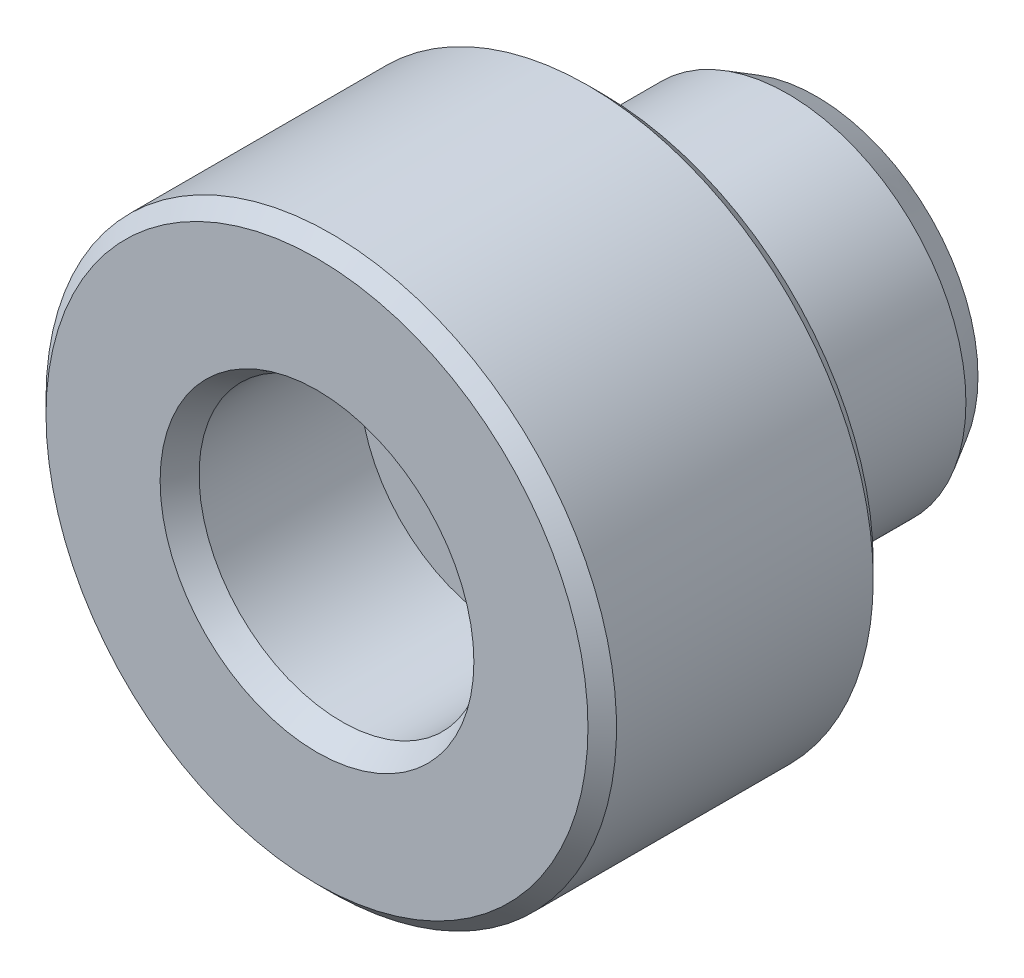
ISO-10303-21;
HEADER;
FILE_DESCRIPTION(('STEP AP214'),'2;1');
FILE_NAME('part.step','',(''),(''),'','','');
FILE_SCHEMA(('AUTOMOTIVE_DESIGN { 1 0 10303 214 1 1 1 1 }'));
ENDSEC;
DATA;
#1=APPLICATION_CONTEXT('core data for automotive mechanical design processes');
#2=APPLICATION_PROTOCOL_DEFINITION('international standard','automotive_design',2000,#1);
#3=PRODUCT_CONTEXT('',#1,'mechanical');
#4=PRODUCT('Part','Part','',(#3));
#5=PRODUCT_RELATED_PRODUCT_CATEGORY('part','',(#4));
#6=PRODUCT_DEFINITION_FORMATION('','',#4);
#7=PRODUCT_DEFINITION_CONTEXT('part definition',#1,'design');
#8=PRODUCT_DEFINITION('design','',#6,#7);
#9=PRODUCT_DEFINITION_SHAPE('','',#8);
#10=(LENGTH_UNIT() NAMED_UNIT(*) SI_UNIT(.MILLI.,.METRE.));
#11=(NAMED_UNIT(*) PLANE_ANGLE_UNIT() SI_UNIT($,.RADIAN.));
#12=(NAMED_UNIT(*) SI_UNIT($,.STERADIAN.) SOLID_ANGLE_UNIT());
#13=UNCERTAINTY_MEASURE_WITH_UNIT(LENGTH_MEASURE(1.E-05),#10,'distance_accuracy_value','');
#14=(GEOMETRIC_REPRESENTATION_CONTEXT(3) GLOBAL_UNCERTAINTY_ASSIGNED_CONTEXT((#13)) GLOBAL_UNIT_ASSIGNED_CONTEXT((#10,
#11,#12)) REPRESENTATION_CONTEXT('',''));
#15=CARTESIAN_POINT('',(0.,0.,0.));
#16=DIRECTION('',(0.,0.,1.));
#17=DIRECTION('',(1.,0.,0.));
#18=AXIS2_PLACEMENT_3D('',#15,#16,#17);
#19=CARTESIAN_POINT('',(0.,0.,-22.5684167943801));
#20=DIRECTION('',(0.,0.,-1.));
#21=DIRECTION('',(-1.,0.,0.));
#22=AXIS2_PLACEMENT_3D('',#19,#20,#21);
#23=CYLINDRICAL_SURFACE('',#22,20.);
#24=CARTESIAN_POINT('',(0.,0.,1.));
#25=DIRECTION('',(0.,0.,1.));
#26=DIRECTION('',(1.,0.,0.));
#27=AXIS2_PLACEMENT_3D('',#24,#25,#26);
#28=CIRCLE('',#27,20.);
#29=CARTESIAN_POINT('',(20.,0.,1.));
#30=VERTEX_POINT('',#29);
#31=EDGE_CURVE('E19',#30,#30,#28,.T.);
#32=ORIENTED_EDGE('',*,*,#31,.T.);
#33=EDGE_LOOP('',(#32));
#34=FACE_BOUND('',#33,.T.);
#35=CARTESIAN_POINT('',(0.,0.,19.));
#36=DIRECTION('',(0.,0.,-1.));
#37=DIRECTION('',(-1.,0.,0.));
#38=AXIS2_PLACEMENT_3D('',#35,#36,#37);
#39=CIRCLE('',#38,20.);
#40=CARTESIAN_POINT('',(-20.,0.,19.));
#41=VERTEX_POINT('',#40);
#42=EDGE_CURVE('E23',#41,#41,#39,.T.);
#43=ORIENTED_EDGE('',*,*,#42,.T.);
#44=EDGE_LOOP('',(#43));
#45=FACE_BOUND('',#44,.T.);
#46=ADVANCED_FACE('F12',(#34,#45),#23,.T.);
#47=CARTESIAN_POINT('',(13.7,0.,0.));
#48=DIRECTION('',(0.,0.,1.));
#49=DIRECTION('',(1.,0.,0.));
#50=AXIS2_PLACEMENT_3D('',#47,#48,#49);
#51=PLANE('',#50);
#52=CARTESIAN_POINT('',(0.,0.,0.));
#53=DIRECTION('',(0.,0.,1.));
#54=DIRECTION('',(1.,0.,0.));
#55=AXIS2_PLACEMENT_3D('',#52,#53,#54);
#56=CIRCLE('',#55,12.5);
#57=CARTESIAN_POINT('',(12.5,0.,0.));
#58=VERTEX_POINT('',#57);
#59=EDGE_CURVE('E56',#58,#58,#56,.T.);
#60=ORIENTED_EDGE('',*,*,#59,.T.);
#61=EDGE_LOOP('',(#60));
#62=FACE_BOUND('',#61,.T.);
#63=CARTESIAN_POINT('',(0.,0.,0.));
#64=DIRECTION('',(0.,0.,1.));
#65=DIRECTION('',(1.,0.,0.));
#66=AXIS2_PLACEMENT_3D('',#63,#64,#65);
#67=CIRCLE('',#66,19.);
#68=CARTESIAN_POINT('',(19.,0.,0.));
#69=VERTEX_POINT('',#68);
#70=EDGE_CURVE('E27',#69,#69,#67,.F.);
#71=ORIENTED_EDGE('',*,*,#70,.T.);
#72=EDGE_LOOP('',(#71));
#73=FACE_BOUND('',#72,.T.);
#74=ADVANCED_FACE('F60',(#62,#73),#51,.F.);
#75=CARTESIAN_POINT('',(0.,0.,-22.5684167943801));
#76=DIRECTION('',(0.,0.,-1.));
#77=DIRECTION('',(-1.,0.,0.));
#78=AXIS2_PLACEMENT_3D('',#75,#76,#77);
#79=CYLINDRICAL_SURFACE('',#78,12.5);
#80=CARTESIAN_POINT('',(0.,0.,-13.));
#81=DIRECTION('',(0.,0.,1.));
#82=DIRECTION('',(1.,0.,0.));
#83=AXIS2_PLACEMENT_3D('',#80,#81,#82);
#84=CIRCLE('',#83,12.5);
#85=CARTESIAN_POINT('',(12.5,0.,-13.));
#86=VERTEX_POINT('',#85);
#87=EDGE_CURVE('E32',#86,#86,#84,.T.);
#88=ORIENTED_EDGE('',*,*,#87,.T.);
#89=EDGE_LOOP('',(#88));
#90=FACE_BOUND('',#89,.T.);
#91=ORIENTED_EDGE('',*,*,#59,.F.);
#92=EDGE_LOOP('',(#91));
#93=FACE_BOUND('',#92,.T.);
#94=ADVANCED_FACE('F63',(#90,#93),#79,.T.);
#95=CARTESIAN_POINT('',(0.,0.,-15.));
#96=DIRECTION('',(0.,0.,1.));
#97=DIRECTION('',(1.,0.,0.));
#98=AXIS2_PLACEMENT_3D('',#95,#96,#97);
#99=PLANE('',#98);
#100=CARTESIAN_POINT('',(0.,0.,-15.));
#101=DIRECTION('',(0.,0.,1.));
#102=DIRECTION('',(1.,0.,0.));
#103=AXIS2_PLACEMENT_3D('',#100,#101,#102);
#104=CIRCLE('',#103,11.3452994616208);
#105=CARTESIAN_POINT('',(11.3452994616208,0.,-15.));
#106=VERTEX_POINT('',#105);
#107=EDGE_CURVE('E35',#106,#106,#104,.F.);
#108=ORIENTED_EDGE('',*,*,#107,.T.);
#109=EDGE_LOOP('',(#108));
#110=FACE_BOUND('',#109,.T.);
#111=CARTESIAN_POINT('',(0.,0.,-15.));
#112=DIRECTION('',(0.,0.,1.));
#113=DIRECTION('',(1.,0.,0.));
#114=AXIS2_PLACEMENT_3D('',#111,#112,#113);
#115=CIRCLE('',#114,8.);
#116=CARTESIAN_POINT('',(8.,0.,-15.));
#117=VERTEX_POINT('',#116);
#118=EDGE_CURVE('E38',#117,#117,#115,.T.);
#119=ORIENTED_EDGE('',*,*,#118,.T.);
#120=EDGE_LOOP('',(#119));
#121=FACE_BOUND('',#120,.T.);
#122=ADVANCED_FACE('F65',(#110,#121),#99,.F.);
#123=CARTESIAN_POINT('',(20.,0.,20.));
#124=DIRECTION('',(0.,0.,-1.));
#125=DIRECTION('',(-1.,0.,0.));
#126=AXIS2_PLACEMENT_3D('',#123,#124,#125);
#127=PLANE('',#126);
#128=CARTESIAN_POINT('',(0.,0.,20.));
#129=DIRECTION('',(0.,0.,-1.));
#130=DIRECTION('',(-1.,0.,0.));
#131=AXIS2_PLACEMENT_3D('',#128,#129,#130);
#132=CIRCLE('',#131,19.);
#133=CARTESIAN_POINT('',(-19.,0.,20.));
#134=VERTEX_POINT('',#133);
#135=EDGE_CURVE('E8',#134,#134,#132,.F.);
#136=ORIENTED_EDGE('',*,*,#135,.T.);
#137=EDGE_LOOP('',(#136));
#138=FACE_BOUND('',#137,.T.);
#139=CARTESIAN_POINT('',(0.,0.,20.));
#140=DIRECTION('',(0.,0.,1.));
#141=DIRECTION('',(1.,0.,0.));
#142=AXIS2_PLACEMENT_3D('',#139,#140,#141);
#143=CIRCLE('',#142,11.);
#144=CARTESIAN_POINT('',(11.,0.,20.));
#145=VERTEX_POINT('',#144);
#146=EDGE_CURVE('E53',#145,#145,#143,.T.);
#147=ORIENTED_EDGE('',*,*,#146,.F.);
#148=EDGE_LOOP('',(#147));
#149=FACE_BOUND('',#148,.T.);
#150=ADVANCED_FACE('F73',(#138,#149),#127,.F.);
#151=CARTESIAN_POINT('',(0.,0.,-13.2679491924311));
#152=DIRECTION('',(0.,0.,-1.));
#153=DIRECTION('',(-1.,0.,0.));
#154=AXIS2_PLACEMENT_3D('',#151,#152,#153);
#155=CONICAL_SURFACE('',#154,7.,0.523598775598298);
#156=ORIENTED_EDGE('',*,*,#118,.F.);
#157=EDGE_LOOP('',(#156));
#158=FACE_BOUND('',#157,.T.);
#159=CARTESIAN_POINT('',(0.,0.,-13.2679491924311));
#160=DIRECTION('',(0.,0.,1.));
#161=DIRECTION('',(1.,0.,0.));
#162=AXIS2_PLACEMENT_3D('',#159,#160,#161);
#163=CIRCLE('',#162,7.);
#164=CARTESIAN_POINT('',(7.,0.,-13.2679491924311));
#165=VERTEX_POINT('',#164);
#166=EDGE_CURVE('E41',#165,#165,#163,.T.);
#167=ORIENTED_EDGE('',*,*,#166,.T.);
#168=EDGE_LOOP('',(#167));
#169=FACE_BOUND('',#168,.T.);
#170=ADVANCED_FACE('F149',(#158,#169),#155,.F.);
#171=CARTESIAN_POINT('',(0.,0.,20.));
#172=DIRECTION('',(0.,0.,1.));
#173=DIRECTION('',(1.,0.,0.));
#174=AXIS2_PLACEMENT_3D('',#171,#172,#173);
#175=CYLINDRICAL_SURFACE('',#174,7.);
#176=ORIENTED_EDGE('',*,*,#166,.F.);
#177=EDGE_LOOP('',(#176));
#178=FACE_BOUND('',#177,.T.);
#179=CARTESIAN_POINT('',(0.,0.,7.));
#180=DIRECTION('',(0.,0.,1.));
#181=DIRECTION('',(1.,0.,0.));
#182=AXIS2_PLACEMENT_3D('',#179,#180,#181);
#183=CIRCLE('',#182,7.);
#184=CARTESIAN_POINT('',(7.,0.,7.));
#185=VERTEX_POINT('',#184);
#186=EDGE_CURVE('E44',#185,#185,#183,.T.);
#187=ORIENTED_EDGE('',*,*,#186,.T.);
#188=EDGE_LOOP('',(#187));
#189=FACE_BOUND('',#188,.T.);
#190=ADVANCED_FACE('F138',(#178,#189),#175,.F.);
#191=CARTESIAN_POINT('',(10.,0.,7.));
#192=DIRECTION('',(0.,0.,-1.));
#193=DIRECTION('',(-1.,0.,0.));
#194=AXIS2_PLACEMENT_3D('',#191,#192,#193);
#195=PLANE('',#194);
#196=ORIENTED_EDGE('',*,*,#186,.F.);
#197=EDGE_LOOP('',(#196));
#198=FACE_BOUND('',#197,.T.);
#199=CARTESIAN_POINT('',(0.,0.,7.));
#200=DIRECTION('',(0.,0.,1.));
#201=DIRECTION('',(1.,0.,0.));
#202=AXIS2_PLACEMENT_3D('',#199,#200,#201);
#203=CIRCLE('',#202,10.);
#204=CARTESIAN_POINT('',(10.,0.,7.));
#205=VERTEX_POINT('',#204);
#206=EDGE_CURVE('E47',#205,#205,#203,.T.);
#207=ORIENTED_EDGE('',*,*,#206,.T.);
#208=EDGE_LOOP('',(#207));
#209=FACE_BOUND('',#208,.T.);
#210=ADVANCED_FACE('F127',(#198,#209),#195,.F.);
#211=CARTESIAN_POINT('',(0.,0.,20.));
#212=DIRECTION('',(0.,0.,1.));
#213=DIRECTION('',(1.,0.,0.));
#214=AXIS2_PLACEMENT_3D('',#211,#212,#213);
#215=CYLINDRICAL_SURFACE('',#214,10.);
#216=ORIENTED_EDGE('',*,*,#206,.F.);
#217=EDGE_LOOP('',(#216));
#218=FACE_BOUND('',#217,.T.);
#219=CARTESIAN_POINT('',(0.,0.,18.2679491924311));
#220=DIRECTION('',(0.,0.,1.));
#221=DIRECTION('',(1.,0.,0.));
#222=AXIS2_PLACEMENT_3D('',#219,#220,#221);
#223=CIRCLE('',#222,10.);
#224=CARTESIAN_POINT('',(10.,0.,18.2679491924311));
#225=VERTEX_POINT('',#224);
#226=EDGE_CURVE('E50',#225,#225,#223,.T.);
#227=ORIENTED_EDGE('',*,*,#226,.T.);
#228=EDGE_LOOP('',(#227));
#229=FACE_BOUND('',#228,.T.);
#230=ADVANCED_FACE('F115',(#218,#229),#215,.F.);
#231=CARTESIAN_POINT('',(0.,0.,20.));
#232=DIRECTION('',(0.,0.,1.));
#233=DIRECTION('',(1.,0.,0.));
#234=AXIS2_PLACEMENT_3D('',#231,#232,#233);
#235=CONICAL_SURFACE('',#234,11.,0.523598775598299);
#236=ORIENTED_EDGE('',*,*,#226,.F.);
#237=EDGE_LOOP('',(#236));
#238=FACE_BOUND('',#237,.T.);
#239=ORIENTED_EDGE('',*,*,#146,.T.);
#240=EDGE_LOOP('',(#239));
#241=FACE_BOUND('',#240,.T.);
#242=ADVANCED_FACE('F86',(#238,#241),#235,.F.);
#243=CARTESIAN_POINT('',(0.,0.,-15.));
#244=DIRECTION('',(0.,0.,1.));
#245=DIRECTION('',(1.,0.,0.));
#246=AXIS2_PLACEMENT_3D('',#243,#244,#245);
#247=CONICAL_SURFACE('',#246,11.3452994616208,0.523598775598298);
#248=ORIENTED_EDGE('',*,*,#87,.F.);
#249=EDGE_LOOP('',(#248));
#250=FACE_BOUND('',#249,.T.);
#251=ORIENTED_EDGE('',*,*,#107,.F.);
#252=EDGE_LOOP('',(#251));
#253=FACE_BOUND('',#252,.T.);
#254=ADVANCED_FACE('F83',(#250,#253),#247,.T.);
#255=CARTESIAN_POINT('',(0.,0.,0.));
#256=DIRECTION('',(0.,0.,1.));
#257=DIRECTION('',(1.,0.,0.));
#258=AXIS2_PLACEMENT_3D('',#255,#256,#257);
#259=CONICAL_SURFACE('',#258,19.,0.785398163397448);
#260=ORIENTED_EDGE('',*,*,#31,.F.);
#261=EDGE_LOOP('',(#260));
#262=FACE_BOUND('',#261,.T.);
#263=ORIENTED_EDGE('',*,*,#70,.F.);
#264=EDGE_LOOP('',(#263));
#265=FACE_BOUND('',#264,.T.);
#266=ADVANCED_FACE('F85',(#262,#265),#259,.T.);
#267=CARTESIAN_POINT('',(0.,0.,19.));
#268=DIRECTION('',(0.,0.,-1.));
#269=DIRECTION('',(-1.,0.,0.));
#270=AXIS2_PLACEMENT_3D('',#267,#268,#269);
#271=CONICAL_SURFACE('',#270,20.,0.785398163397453);
#272=ORIENTED_EDGE('',*,*,#135,.F.);
#273=EDGE_LOOP('',(#272));
#274=FACE_BOUND('',#273,.T.);
#275=ORIENTED_EDGE('',*,*,#42,.F.);
#276=EDGE_LOOP('',(#275));
#277=FACE_BOUND('',#276,.T.);
#278=ADVANCED_FACE('F14',(#274,#277),#271,.T.);
#279=CLOSED_SHELL('',(#46,#74,#94,#122,#150,#170,#190,#210,#230,#242,#254,#266,#278));
#280=MANIFOLD_SOLID_BREP('B1',#279);
#281=ADVANCED_BREP_SHAPE_REPRESENTATION('',(#18,#280),#14);
#282=SHAPE_DEFINITION_REPRESENTATION(#9,#281);
ENDSEC;
END-ISO-10303-21;
